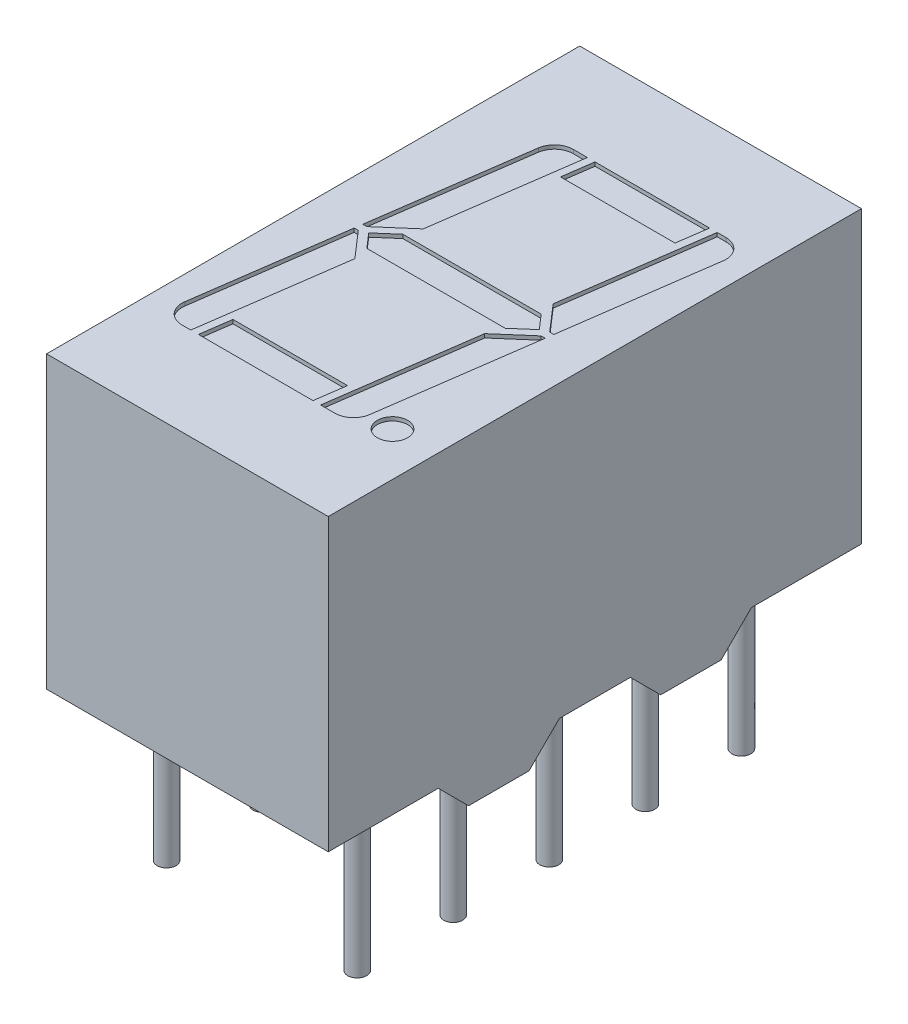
from build123d import *

# Parameters (mm, degrees)
EXTRUDE_1_DEPTH          = 7.05
CUT_EXTRUDE_4_DEPTH      = 12.639953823
CUT_EXTRUDE_4_DEPTH_BACK = 12.639953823
EXTRUDE_2_DEPTH          = 2.5
EXTRUDE_2_DEPTH_BACK     = 3.5
SKETCH_2_R               = 0.25
SKETCH_3_R               = 0.4
CUT_EXTRUDE_3_DEPTH      = 0.1


with BuildPart() as part:
    # Sketch 1 → Extrude 1 (new, symmetric)
    with BuildSketch(Plane.XY):
        Polygon((-3.725, 0), (-2.9, 0), (-2.9, 0.8), (2.9, 0.8), (2.9, 0), (3.725, 0), (3.725, 8.48), (-3.725, 8.48), align=None)
    extrude(amount=EXTRUDE_1_DEPTH, both=True)

    # Sketch 4 → Cut-Extrude 4 (cut, two sides: drawn at the far end of the back side and taken through both)
    with BuildSketch(Plane(origin=(0, 0, 0), x_dir=(0, 0, -1), z_dir=(1, 0, 0)).offset(-CUT_EXTRUDE_4_DEPTH_BACK)):
        Polygon((-49.161829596, 0.8), (-7.05, 0.8), (-4.14, 0.8), (-3.34, 0), (-1.74, 0), (-0.94, 0.8), (0.94, 0.8), (1.74, 0), (3.34, 0), (4.14, 0.8), (7.05, 0.8), (49.161829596, 0.8), (49.161829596, -83.423659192), (-49.161829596, -83.423659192), align=None)
    extrude(amount=CUT_EXTRUDE_4_DEPTH + CUT_EXTRUDE_4_DEPTH_BACK, mode=Mode.SUBTRACT)

    # Sketch 2 → Extrude 2 (add, two sides: drawn at the far end of the back side and taken through both)
    with BuildSketch(Plane(origin=(0, 0, 0), x_dir=(1, 0, 0), z_dir=(0, 1, 0)).offset(-EXTRUDE_2_DEPTH_BACK)):
        with Locations(Location((-2.52, -5.08, 0), (0, 0, 180))):
            Circle(SKETCH_2_R)
        with Locations(Location((2.52, -5.08, 0), (0, 0, 180))):
            Circle(SKETCH_2_R)
        with Locations(Location((-2.52, -2.54, 0), (0, 0, 180))):
            Circle(SKETCH_2_R)
        with Locations(Location((2.52, -2.54, 0), (0, 0, 180))):
            Circle(SKETCH_2_R)
        with Locations(Location((-2.52, 0, 0), (0, 0, 180))):
            Circle(SKETCH_2_R)
        with Locations(Location((2.52, 0, 0), (0, 0, 180))):
            Circle(SKETCH_2_R)
        with Locations(Location((-2.52, 2.54, 0), (0, 0, 180))):
            Circle(SKETCH_2_R)
        with Locations(Location((2.52, 2.54, 0), (0, 0, 180))):
            Circle(SKETCH_2_R)
        with Locations(Location((-2.52, 5.08, 0), (0, 0, 180))):
            Circle(SKETCH_2_R)
        with Locations(Location((2.52, 5.08, 0), (0, 0, 180))):
            Circle(SKETCH_2_R)
    extrude(amount=EXTRUDE_2_DEPTH + EXTRUDE_2_DEPTH_BACK)

    # Sketch 3 → Cut-Extrude 3 (cut)
    with BuildSketch(Plane(origin=(0, 8.48, 0), x_dir=(-1, 0, 0), z_dir=(0, 1, 0))):
        with Locations((-2.570570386, 4.1975)):
            Circle(SKETCH_3_R)
        with BuildLine():
            Line((3.09065525, 4.02791345), (2.538623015, 0.1))
            Line((2.538623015, 0.1), (2.430760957, 0.1))
            Line((2.430760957, 0.1), (1.828182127, 0.793187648))
            Line((1.828182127, 0.793187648), (2.362843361, 4.5975))
            Line((2.362843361, 4.5975), (2.595521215, 4.5975))
            ThreePointArc((2.595521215, 4.5975), (2.972876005, 4.425529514), (3.09065525, 4.02791345))
        make_face()
        with BuildLine():
            Line((2.510514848, -0.1), (1.938923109, -4.16708655))
            ThreePointArc((1.938923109, -4.16708655), (1.771818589, -4.47485479), (1.443789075, -4.5975))
            Line((1.443789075, -4.5975), (1.070570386, -4.5975))
            Line((1.070570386, -4.5975), (1.605231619, -0.793187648))
            Line((1.605231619, -0.793187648), (2.40265279, -0.1))
            Line((2.40265279, -0.1), (2.510514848, -0.1))
        make_face()
        with BuildLine():
            Line((-1.828182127, -0.793187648), (-2.362843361, -4.5975))
            Line((-2.362843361, -4.5975), (-2.595521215, -4.5975))
            ThreePointArc((-2.595521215, -4.5975), (-2.972876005, -4.425529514), (-3.09065525, -4.02791345))
            Line((-3.09065525, -4.02791345), (-2.538623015, -0.1))
            Line((-2.538623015, -0.1), (-2.430760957, -0.1))
            Line((-2.430760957, -0.1), (-1.828182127, -0.793187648))
        make_face()
        with BuildLine():
            Line((-1.070570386, 4.5975), (-1.605231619, 0.793187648))
            Line((-1.605231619, 0.793187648), (-2.40265279, 0.1))
            Line((-2.40265279, 0.1), (-2.510514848, 0.1))
            Line((-2.510514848, 0.1), (-1.938923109, 4.16708655))
            ThreePointArc((-1.938923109, 4.16708655), (-1.771818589, 4.47485479), (-1.443789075, 4.5975))
            Line((-1.443789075, 4.5975), (-1.070570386, 4.5975))
        make_face()
        Polygon((2.160877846, 4.5975), (2.048445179, 3.7975), (-0.981037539, 3.7975), (-0.868604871, 4.5975), align=None)
        Polygon((0.981037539, -3.7975), (-2.048445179, -3.7975), (-2.160877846, -4.5975), (0.868604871, -4.5975), align=None)
        Polygon((1.75269165, -0.4), (-1.904972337, -0.4), (-2.235535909, -0.01973011), (-1.75269165, 0.4), (1.904972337, 0.4), (2.235535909, 0.01973011), align=None)
    extrude(amount=-CUT_EXTRUDE_3_DEPTH, mode=Mode.SUBTRACT)


solid = part.part
